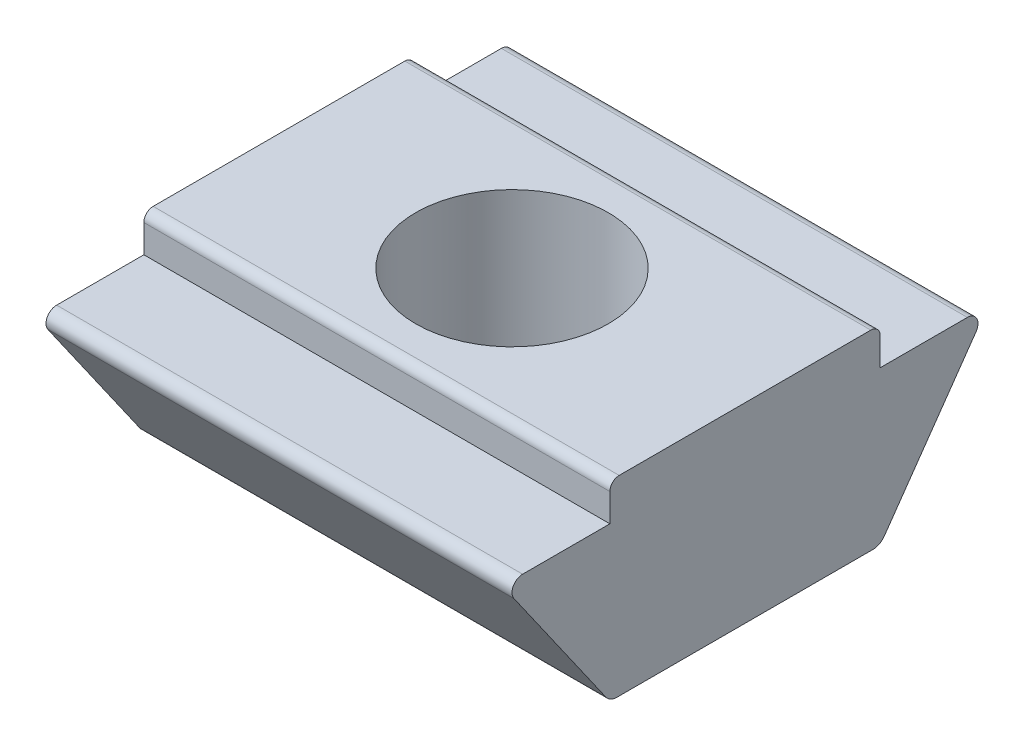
ISO-10303-21;
HEADER;
FILE_DESCRIPTION(('STEP AP214'),'2;1');
FILE_NAME('part.step','',(''),(''),'','','');
FILE_SCHEMA(('AUTOMOTIVE_DESIGN { 1 0 10303 214 1 1 1 1 }'));
ENDSEC;
DATA;
#1=APPLICATION_CONTEXT('core data for automotive mechanical design processes');
#2=APPLICATION_PROTOCOL_DEFINITION('international standard','automotive_design',2000,#1);
#3=PRODUCT_CONTEXT('',#1,'mechanical');
#4=PRODUCT('Part','Part','',(#3));
#5=PRODUCT_RELATED_PRODUCT_CATEGORY('part','',(#4));
#6=PRODUCT_DEFINITION_FORMATION('','',#4);
#7=PRODUCT_DEFINITION_CONTEXT('part definition',#1,'design');
#8=PRODUCT_DEFINITION('design','',#6,#7);
#9=PRODUCT_DEFINITION_SHAPE('','',#8);
#10=(LENGTH_UNIT() NAMED_UNIT(*) SI_UNIT(.MILLI.,.METRE.));
#11=(NAMED_UNIT(*) PLANE_ANGLE_UNIT() SI_UNIT($,.RADIAN.));
#12=(NAMED_UNIT(*) SI_UNIT($,.STERADIAN.) SOLID_ANGLE_UNIT());
#13=UNCERTAINTY_MEASURE_WITH_UNIT(LENGTH_MEASURE(1.E-05),#10,'distance_accuracy_value','');
#14=(GEOMETRIC_REPRESENTATION_CONTEXT(3) GLOBAL_UNCERTAINTY_ASSIGNED_CONTEXT((#13)) GLOBAL_UNIT_ASSIGNED_CONTEXT((#10,
#11,#12)) REPRESENTATION_CONTEXT('',''));
#15=CARTESIAN_POINT('',(0.,0.,0.));
#16=DIRECTION('',(0.,0.,1.));
#17=DIRECTION('',(1.,0.,0.));
#18=AXIS2_PLACEMENT_3D('',#15,#16,#17);
#19=CARTESIAN_POINT('',(5.,-0.358745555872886,-4.95878757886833));
#20=DIRECTION('',(0.,0.57344542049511,0.819243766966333));
#21=DIRECTION('',(0.,-0.819243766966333,0.57344542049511));
#22=AXIS2_PLACEMENT_3D('',#19,#20,#21);
#23=PLANE('',#22);
#24=DIRECTION('',(0.,0.819243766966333,-0.57344542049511));
#25=VECTOR('',#24,1.);
#26=CARTESIAN_POINT('',(5.,-0.358745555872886,-4.95878757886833));
#27=LINE('',#26,#25);
#28=CARTESIAN_POINT('',(5.,-3.17203362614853,-2.98957252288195));
#29=VERTEX_POINT('',#28);
#30=CARTESIAN_POINT('',(5.,-0.358745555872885,-4.95878757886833));
#31=VERTEX_POINT('',#30);
#32=EDGE_CURVE('E136',#29,#31,#27,.T.);
#33=ORIENTED_EDGE('',*,*,#32,.F.);
#34=DIRECTION('',(-1.,0.,0.));
#35=VECTOR('',#34,1.);
#36=CARTESIAN_POINT('',(5.,-3.17203362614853,-2.98957252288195));
#37=LINE('',#36,#35);
#38=CARTESIAN_POINT('',(-5.,-3.17203362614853,-2.98957252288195));
#39=VERTEX_POINT('',#38);
#40=EDGE_CURVE('E183',#29,#39,#37,.T.);
#41=ORIENTED_EDGE('',*,*,#40,.T.);
#42=DIRECTION('',(0.,0.819243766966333,-0.57344542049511));
#43=VECTOR('',#42,1.);
#44=CARTESIAN_POINT('',(-5.,-0.358745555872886,-4.95878757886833));
#45=LINE('',#44,#43);
#46=CARTESIAN_POINT('',(-5.,-0.358745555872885,-4.95878757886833));
#47=VERTEX_POINT('',#46);
#48=EDGE_CURVE('E158',#39,#47,#45,.T.);
#49=ORIENTED_EDGE('',*,*,#48,.T.);
#50=DIRECTION('',(-1.,0.,0.));
#51=VECTOR('',#50,1.);
#52=CARTESIAN_POINT('',(5.,-0.358745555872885,-4.95878757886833));
#53=LINE('',#52,#51);
#54=EDGE_CURVE('E151',#31,#47,#53,.T.);
#55=ORIENTED_EDGE('',*,*,#54,.F.);
#56=EDGE_LOOP('',(#33,#41,#49,#55));
#57=FACE_BOUND('',#56,.T.);
#58=ADVANCED_FACE('F34',(#57),#23,.F.);
#59=CARTESIAN_POINT('',(5.,-0.227999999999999,-4.772));
#60=DIRECTION('',(-1.,0.,0.));
#61=DIRECTION('',(0.,0.,1.));
#62=AXIS2_PLACEMENT_3D('',#59,#60,#61);
#63=CYLINDRICAL_SURFACE('',#62,0.228000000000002);
#64=CARTESIAN_POINT('',(-5.,-0.227999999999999,-4.772));
#65=DIRECTION('',(1.,0.,0.));
#66=DIRECTION('',(0.,0.,1.));
#67=AXIS2_PLACEMENT_3D('',#64,#65,#66);
#68=CIRCLE('',#67,0.228000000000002);
#69=CARTESIAN_POINT('',(-5.,0.,-4.772));
#70=VERTEX_POINT('',#69);
#71=EDGE_CURVE('E244',#47,#70,#68,.T.);
#72=ORIENTED_EDGE('',*,*,#71,.T.);
#73=DIRECTION('',(-1.,0.,0.));
#74=VECTOR('',#73,1.);
#75=CARTESIAN_POINT('',(5.,0.,-4.772));
#76=LINE('',#75,#74);
#77=CARTESIAN_POINT('',(5.,0.,-4.772));
#78=VERTEX_POINT('',#77);
#79=EDGE_CURVE('E153',#78,#70,#76,.T.);
#80=ORIENTED_EDGE('',*,*,#79,.F.);
#81=CARTESIAN_POINT('',(5.,-0.227999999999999,-4.772));
#82=DIRECTION('',(1.,0.,0.));
#83=DIRECTION('',(0.,0.,1.));
#84=AXIS2_PLACEMENT_3D('',#81,#82,#83);
#85=CIRCLE('',#84,0.228000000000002);
#86=EDGE_CURVE('E139',#31,#78,#85,.T.);
#87=ORIENTED_EDGE('',*,*,#86,.F.);
#88=ORIENTED_EDGE('',*,*,#54,.T.);
#89=EDGE_LOOP('',(#72,#80,#87,#88));
#90=FACE_BOUND('',#89,.T.);
#91=ADVANCED_FACE('F150',(#90),#63,.T.);
#92=CARTESIAN_POINT('',(5.,0.,-2.9));
#93=DIRECTION('',(0.,-1.,0.));
#94=DIRECTION('',(0.,0.,-1.));
#95=AXIS2_PLACEMENT_3D('',#92,#93,#94);
#96=PLANE('',#95);
#97=DIRECTION('',(0.,0.,1.));
#98=VECTOR('',#97,1.);
#99=CARTESIAN_POINT('',(-5.,0.,-2.9));
#100=LINE('',#99,#98);
#101=CARTESIAN_POINT('',(-5.,0.,-2.9));
#102=VERTEX_POINT('',#101);
#103=EDGE_CURVE('E237',#70,#102,#100,.T.);
#104=ORIENTED_EDGE('',*,*,#103,.T.);
#105=DIRECTION('',(-1.,0.,0.));
#106=VECTOR('',#105,1.);
#107=CARTESIAN_POINT('',(5.,0.,-2.9));
#108=LINE('',#107,#106);
#109=CARTESIAN_POINT('',(5.,0.,-2.9));
#110=VERTEX_POINT('',#109);
#111=EDGE_CURVE('E164',#110,#102,#108,.T.);
#112=ORIENTED_EDGE('',*,*,#111,.F.);
#113=DIRECTION('',(0.,0.,1.));
#114=VECTOR('',#113,1.);
#115=CARTESIAN_POINT('',(5.,0.,-2.9));
#116=LINE('',#115,#114);
#117=EDGE_CURVE('E155',#78,#110,#116,.T.);
#118=ORIENTED_EDGE('',*,*,#117,.F.);
#119=ORIENTED_EDGE('',*,*,#79,.T.);
#120=EDGE_LOOP('',(#104,#112,#118,#119));
#121=FACE_BOUND('',#120,.T.);
#122=ADVANCED_FACE('F267',(#121),#96,.F.);
#123=CARTESIAN_POINT('',(5.,0.799999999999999,-2.9));
#124=DIRECTION('',(0.,0.,1.));
#125=DIRECTION('',(1.,0.,0.));
#126=AXIS2_PLACEMENT_3D('',#123,#124,#125);
#127=PLANE('',#126);
#128=DIRECTION('',(0.,1.,0.));
#129=VECTOR('',#128,1.);
#130=CARTESIAN_POINT('',(-5.,0.799999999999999,-2.9));
#131=LINE('',#130,#129);
#132=CARTESIAN_POINT('',(-5.,0.6,-2.9));
#133=VERTEX_POINT('',#132);
#134=EDGE_CURVE('E231',#102,#133,#131,.T.);
#135=ORIENTED_EDGE('',*,*,#134,.T.);
#136=DIRECTION('',(-1.,0.,0.));
#137=VECTOR('',#136,1.);
#138=CARTESIAN_POINT('',(5.,0.6,-2.9));
#139=LINE('',#138,#137);
#140=CARTESIAN_POINT('',(5.,0.6,-2.9));
#141=VERTEX_POINT('',#140);
#142=EDGE_CURVE('E174',#133,#141,#139,.F.);
#143=ORIENTED_EDGE('',*,*,#142,.T.);
#144=DIRECTION('',(0.,1.,0.));
#145=VECTOR('',#144,1.);
#146=CARTESIAN_POINT('',(5.,0.799999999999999,-2.9));
#147=LINE('',#146,#145);
#148=EDGE_CURVE('E234',#110,#141,#147,.T.);
#149=ORIENTED_EDGE('',*,*,#148,.F.);
#150=ORIENTED_EDGE('',*,*,#111,.T.);
#151=EDGE_LOOP('',(#135,#143,#149,#150));
#152=FACE_BOUND('',#151,.T.);
#153=ADVANCED_FACE('F230',(#152),#127,.F.);
#154=CARTESIAN_POINT('',(5.,0.799999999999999,2.9));
#155=DIRECTION('',(0.,-1.,0.));
#156=DIRECTION('',(0.,0.,-1.));
#157=AXIS2_PLACEMENT_3D('',#154,#155,#156);
#158=PLANE('',#157);
#159=CARTESIAN_POINT('',(0.,0.799999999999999,0.));
#160=DIRECTION('',(0.,1.,0.));
#161=DIRECTION('',(0.,0.,1.));
#162=AXIS2_PLACEMENT_3D('',#159,#160,#161);
#163=CIRCLE('',#162,2.067);
#164=CARTESIAN_POINT('',(0.,0.799999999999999,2.067));
#165=VERTEX_POINT('',#164);
#166=EDGE_CURVE('E336',#165,#165,#163,.T.);
#167=ORIENTED_EDGE('',*,*,#166,.F.);
#168=EDGE_LOOP('',(#167));
#169=FACE_BOUND('',#168,.T.);
#170=DIRECTION('',(0.,0.,1.));
#171=VECTOR('',#170,1.);
#172=CARTESIAN_POINT('',(5.,0.799999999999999,2.9));
#173=LINE('',#172,#171);
#174=CARTESIAN_POINT('',(5.,0.799999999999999,-2.7));
#175=VERTEX_POINT('',#174);
#176=CARTESIAN_POINT('',(5.,0.799999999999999,2.7));
#177=VERTEX_POINT('',#176);
#178=EDGE_CURVE('E269',#175,#177,#173,.T.);
#179=ORIENTED_EDGE('',*,*,#178,.F.);
#180=DIRECTION('',(-1.,0.,0.));
#181=VECTOR('',#180,1.);
#182=CARTESIAN_POINT('',(5.,0.799999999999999,-2.7));
#183=LINE('',#182,#181);
#184=CARTESIAN_POINT('',(-5.,0.799999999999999,-2.7));
#185=VERTEX_POINT('',#184);
#186=EDGE_CURVE('E162',#175,#185,#183,.T.);
#187=ORIENTED_EDGE('',*,*,#186,.T.);
#188=DIRECTION('',(0.,0.,1.));
#189=VECTOR('',#188,1.);
#190=CARTESIAN_POINT('',(-5.,0.799999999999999,2.9));
#191=LINE('',#190,#189);
#192=CARTESIAN_POINT('',(-5.,0.799999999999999,2.7));
#193=VERTEX_POINT('',#192);
#194=EDGE_CURVE('E239',#185,#193,#191,.T.);
#195=ORIENTED_EDGE('',*,*,#194,.T.);
#196=DIRECTION('',(-1.,0.,0.));
#197=VECTOR('',#196,1.);
#198=CARTESIAN_POINT('',(5.,0.799999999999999,2.7));
#199=LINE('',#198,#197);
#200=EDGE_CURVE('E160',#193,#177,#199,.F.);
#201=ORIENTED_EDGE('',*,*,#200,.T.);
#202=EDGE_LOOP('',(#179,#187,#195,#201));
#203=FACE_BOUND('',#202,.T.);
#204=ADVANCED_FACE('F282',(#169,#203),#158,.F.);
#205=CARTESIAN_POINT('',(5.,0.,2.9));
#206=DIRECTION('',(0.,0.,-1.));
#207=DIRECTION('',(-1.,0.,0.));
#208=AXIS2_PLACEMENT_3D('',#205,#206,#207);
#209=PLANE('',#208);
#210=DIRECTION('',(0.,-1.,0.));
#211=VECTOR('',#210,1.);
#212=CARTESIAN_POINT('',(5.,0.,2.9));
#213=LINE('',#212,#211);
#214=CARTESIAN_POINT('',(5.,0.599999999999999,2.9));
#215=VERTEX_POINT('',#214);
#216=CARTESIAN_POINT('',(5.,0.,2.9));
#217=VERTEX_POINT('',#216);
#218=EDGE_CURVE('E262',#215,#217,#213,.T.);
#219=ORIENTED_EDGE('',*,*,#218,.F.);
#220=DIRECTION('',(-1.,0.,0.));
#221=VECTOR('',#220,1.);
#222=CARTESIAN_POINT('',(5.,0.599999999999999,2.9));
#223=LINE('',#222,#221);
#224=CARTESIAN_POINT('',(-5.,0.599999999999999,2.9));
#225=VERTEX_POINT('',#224);
#226=EDGE_CURVE('E180',#215,#225,#223,.T.);
#227=ORIENTED_EDGE('',*,*,#226,.T.);
#228=DIRECTION('',(0.,-1.,0.));
#229=VECTOR('',#228,1.);
#230=CARTESIAN_POINT('',(-5.,0.,2.9));
#231=LINE('',#230,#229);
#232=CARTESIAN_POINT('',(-5.,0.,2.9));
#233=VERTEX_POINT('',#232);
#234=EDGE_CURVE('E242',#225,#233,#231,.T.);
#235=ORIENTED_EDGE('',*,*,#234,.T.);
#236=DIRECTION('',(-1.,0.,0.));
#237=VECTOR('',#236,1.);
#238=CARTESIAN_POINT('',(5.,0.,2.9));
#239=LINE('',#238,#237);
#240=EDGE_CURVE('E222',#217,#233,#239,.T.);
#241=ORIENTED_EDGE('',*,*,#240,.F.);
#242=EDGE_LOOP('',(#219,#227,#235,#241));
#243=FACE_BOUND('',#242,.T.);
#244=ADVANCED_FACE('F277',(#243),#209,.F.);
#245=CARTESIAN_POINT('',(5.,0.,4.772));
#246=DIRECTION('',(0.,-1.,0.));
#247=DIRECTION('',(0.,0.,-1.));
#248=AXIS2_PLACEMENT_3D('',#245,#246,#247);
#249=PLANE('',#248);
#250=DIRECTION('',(0.,0.,1.));
#251=VECTOR('',#250,1.);
#252=CARTESIAN_POINT('',(-5.,0.,4.772));
#253=LINE('',#252,#251);
#254=CARTESIAN_POINT('',(-5.,0.,4.772));
#255=VERTEX_POINT('',#254);
#256=EDGE_CURVE('E214',#233,#255,#253,.T.);
#257=ORIENTED_EDGE('',*,*,#256,.T.);
#258=DIRECTION('',(-1.,0.,0.));
#259=VECTOR('',#258,1.);
#260=CARTESIAN_POINT('',(5.,0.,4.772));
#261=LINE('',#260,#259);
#262=CARTESIAN_POINT('',(5.,0.,4.772));
#263=VERTEX_POINT('',#262);
#264=EDGE_CURVE('E219',#263,#255,#261,.T.);
#265=ORIENTED_EDGE('',*,*,#264,.F.);
#266=DIRECTION('',(0.,0.,1.));
#267=VECTOR('',#266,1.);
#268=CARTESIAN_POINT('',(5.,0.,4.772));
#269=LINE('',#268,#267);
#270=EDGE_CURVE('E259',#217,#263,#269,.T.);
#271=ORIENTED_EDGE('',*,*,#270,.F.);
#272=ORIENTED_EDGE('',*,*,#240,.T.);
#273=EDGE_LOOP('',(#257,#265,#271,#272));
#274=FACE_BOUND('',#273,.T.);
#275=ADVANCED_FACE('F251',(#274),#249,.F.);
#276=CARTESIAN_POINT('',(5.,-0.228,4.772));
#277=DIRECTION('',(-1.,0.,0.));
#278=DIRECTION('',(0.,0.,1.));
#279=AXIS2_PLACEMENT_3D('',#276,#277,#278);
#280=CYLINDRICAL_SURFACE('',#279,0.228000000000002);
#281=CARTESIAN_POINT('',(-5.,-0.228,4.772));
#282=DIRECTION('',(1.,0.,0.));
#283=DIRECTION('',(0.,0.,1.));
#284=AXIS2_PLACEMENT_3D('',#281,#282,#283);
#285=CIRCLE('',#284,0.228000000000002);
#286=CARTESIAN_POINT('',(-5.,-0.358745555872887,4.95878757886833));
#287=VERTEX_POINT('',#286);
#288=EDGE_CURVE('E211',#255,#287,#285,.T.);
#289=ORIENTED_EDGE('',*,*,#288,.T.);
#290=DIRECTION('',(-1.,0.,0.));
#291=VECTOR('',#290,1.);
#292=CARTESIAN_POINT('',(5.,-0.358745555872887,4.95878757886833));
#293=LINE('',#292,#291);
#294=CARTESIAN_POINT('',(5.,-0.358745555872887,4.95878757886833));
#295=VERTEX_POINT('',#294);
#296=EDGE_CURVE('E201',#295,#287,#293,.T.);
#297=ORIENTED_EDGE('',*,*,#296,.F.);
#298=CARTESIAN_POINT('',(5.,-0.228,4.772));
#299=DIRECTION('',(1.,0.,0.));
#300=DIRECTION('',(0.,0.,1.));
#301=AXIS2_PLACEMENT_3D('',#298,#299,#300);
#302=CIRCLE('',#301,0.228000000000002);
#303=EDGE_CURVE('E258',#263,#295,#302,.T.);
#304=ORIENTED_EDGE('',*,*,#303,.F.);
#305=ORIENTED_EDGE('',*,*,#264,.T.);
#306=EDGE_LOOP('',(#289,#297,#304,#305));
#307=FACE_BOUND('',#306,.T.);
#308=ADVANCED_FACE('F257',(#307),#280,.T.);
#309=CARTESIAN_POINT('',(5.,-3.3,2.9));
#310=DIRECTION('',(0.,0.57344542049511,-0.819243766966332));
#311=DIRECTION('',(0.,0.819243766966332,0.57344542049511));
#312=AXIS2_PLACEMENT_3D('',#309,#310,#311);
#313=PLANE('',#312);
#314=DIRECTION('',(0.,-0.819243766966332,-0.57344542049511));
#315=VECTOR('',#314,1.);
#316=CARTESIAN_POINT('',(-5.,-3.3,2.9));
#317=LINE('',#316,#315);
#318=CARTESIAN_POINT('',(-5.,-3.17203362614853,2.98957252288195));
#319=VERTEX_POINT('',#318);
#320=EDGE_CURVE('E207',#287,#319,#317,.T.);
#321=ORIENTED_EDGE('',*,*,#320,.T.);
#322=DIRECTION('',(-1.,0.,0.));
#323=VECTOR('',#322,1.);
#324=CARTESIAN_POINT('',(5.,-3.17203362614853,2.98957252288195));
#325=LINE('',#324,#323);
#326=CARTESIAN_POINT('',(5.,-3.17203362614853,2.98957252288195));
#327=VERTEX_POINT('',#326);
#328=EDGE_CURVE('E11',#319,#327,#325,.F.);
#329=ORIENTED_EDGE('',*,*,#328,.T.);
#330=DIRECTION('',(0.,-0.819243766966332,-0.57344542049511));
#331=VECTOR('',#330,1.);
#332=CARTESIAN_POINT('',(5.,-3.3,2.9));
#333=LINE('',#332,#331);
#334=EDGE_CURVE('E196',#295,#327,#333,.T.);
#335=ORIENTED_EDGE('',*,*,#334,.F.);
#336=ORIENTED_EDGE('',*,*,#296,.T.);
#337=EDGE_LOOP('',(#321,#329,#335,#336));
#338=FACE_BOUND('',#337,.T.);
#339=ADVANCED_FACE('F209',(#338),#313,.F.);
#340=CARTESIAN_POINT('',(5.,-3.3,-2.9));
#341=DIRECTION('',(0.,1.,0.));
#342=DIRECTION('',(0.,0.,1.));
#343=AXIS2_PLACEMENT_3D('',#340,#341,#342);
#344=PLANE('',#343);
#345=CARTESIAN_POINT('',(0.,-3.3,0.));
#346=DIRECTION('',(0.,1.,0.));
#347=DIRECTION('',(0.,0.,1.));
#348=AXIS2_PLACEMENT_3D('',#345,#346,#347);
#349=CIRCLE('',#348,2.067);
#350=CARTESIAN_POINT('',(0.,-3.3,2.067));
#351=VERTEX_POINT('',#350);
#352=EDGE_CURVE('E266',#351,#351,#349,.T.);
#353=ORIENTED_EDGE('',*,*,#352,.T.);
#354=EDGE_LOOP('',(#353));
#355=FACE_BOUND('',#354,.T.);
#356=DIRECTION('',(0.,0.,-1.));
#357=VECTOR('',#356,1.);
#358=CARTESIAN_POINT('',(-5.,-3.3,-2.9));
#359=LINE('',#358,#357);
#360=CARTESIAN_POINT('',(-5.,-3.3,2.74379939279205));
#361=VERTEX_POINT('',#360);
#362=CARTESIAN_POINT('',(-5.,-3.3,-2.74379939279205));
#363=VERTEX_POINT('',#362);
#364=EDGE_CURVE('E146',#361,#363,#359,.T.);
#365=ORIENTED_EDGE('',*,*,#364,.T.);
#366=DIRECTION('',(-1.,0.,0.));
#367=VECTOR('',#366,1.);
#368=CARTESIAN_POINT('',(5.,-3.3,-2.74379939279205));
#369=LINE('',#368,#367);
#370=CARTESIAN_POINT('',(5.,-3.3,-2.74379939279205));
#371=VERTEX_POINT('',#370);
#372=EDGE_CURVE('E55',#363,#371,#369,.F.);
#373=ORIENTED_EDGE('',*,*,#372,.T.);
#374=DIRECTION('',(0.,0.,-1.));
#375=VECTOR('',#374,1.);
#376=CARTESIAN_POINT('',(5.,-3.3,-2.9));
#377=LINE('',#376,#375);
#378=CARTESIAN_POINT('',(5.,-3.3,2.74379939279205));
#379=VERTEX_POINT('',#378);
#380=EDGE_CURVE('E195',#379,#371,#377,.T.);
#381=ORIENTED_EDGE('',*,*,#380,.F.);
#382=DIRECTION('',(-1.,0.,0.));
#383=VECTOR('',#382,1.);
#384=CARTESIAN_POINT('',(5.,-3.3,2.74379939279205));
#385=LINE('',#384,#383);
#386=EDGE_CURVE('E189',#379,#361,#385,.T.);
#387=ORIENTED_EDGE('',*,*,#386,.T.);
#388=EDGE_LOOP('',(#365,#373,#381,#387));
#389=FACE_BOUND('',#388,.T.);
#390=ADVANCED_FACE('F199',(#355,#389),#344,.F.);
#391=CARTESIAN_POINT('',(5.,-0.228,4.772));
#392=DIRECTION('',(-1.,0.,0.));
#393=DIRECTION('',(0.,0.,1.));
#394=AXIS2_PLACEMENT_3D('',#391,#392,#393);
#395=PLANE('',#394);
#396=ORIENTED_EDGE('',*,*,#380,.T.);
#397=CARTESIAN_POINT('',(5.,-3.,-2.74379939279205));
#398=DIRECTION('',(-1.,0.,0.));
#399=DIRECTION('',(0.,0.,1.));
#400=AXIS2_PLACEMENT_3D('',#397,#398,#399);
#401=CIRCLE('',#400,0.3);
#402=EDGE_CURVE('E42',#371,#29,#401,.F.);
#403=ORIENTED_EDGE('',*,*,#402,.T.);
#404=ORIENTED_EDGE('',*,*,#32,.T.);
#405=ORIENTED_EDGE('',*,*,#86,.T.);
#406=ORIENTED_EDGE('',*,*,#117,.T.);
#407=ORIENTED_EDGE('',*,*,#148,.T.);
#408=CARTESIAN_POINT('',(5.,0.6,-2.7));
#409=DIRECTION('',(-1.,0.,0.));
#410=DIRECTION('',(0.,0.,1.));
#411=AXIS2_PLACEMENT_3D('',#408,#409,#410);
#412=CIRCLE('',#411,0.2);
#413=EDGE_CURVE('E178',#141,#175,#412,.F.);
#414=ORIENTED_EDGE('',*,*,#413,.T.);
#415=ORIENTED_EDGE('',*,*,#178,.T.);
#416=CARTESIAN_POINT('',(5.,0.599999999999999,2.7));
#417=DIRECTION('',(-1.,0.,0.));
#418=DIRECTION('',(0.,0.,1.));
#419=AXIS2_PLACEMENT_3D('',#416,#417,#418);
#420=CIRCLE('',#419,0.2);
#421=EDGE_CURVE('E176',#177,#215,#420,.F.);
#422=ORIENTED_EDGE('',*,*,#421,.T.);
#423=ORIENTED_EDGE('',*,*,#218,.T.);
#424=ORIENTED_EDGE('',*,*,#270,.T.);
#425=ORIENTED_EDGE('',*,*,#303,.T.);
#426=ORIENTED_EDGE('',*,*,#334,.T.);
#427=CARTESIAN_POINT('',(5.,-3.,2.74379939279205));
#428=DIRECTION('',(-1.,0.,0.));
#429=DIRECTION('',(0.,0.,1.));
#430=AXIS2_PLACEMENT_3D('',#427,#428,#429);
#431=CIRCLE('',#430,0.3);
#432=EDGE_CURVE('E193',#327,#379,#431,.F.);
#433=ORIENTED_EDGE('',*,*,#432,.T.);
#434=EDGE_LOOP('',(#396,#403,#404,#405,#406,#407,#414,#415,#422,#423,#424,#425,#426,#433));
#435=FACE_BOUND('',#434,.T.);
#436=ADVANCED_FACE('F138',(#435),#395,.F.);
#437=CARTESIAN_POINT('',(-5.,-0.228,4.772));
#438=DIRECTION('',(-1.,0.,0.));
#439=DIRECTION('',(0.,0.,1.));
#440=AXIS2_PLACEMENT_3D('',#437,#438,#439);
#441=PLANE('',#440);
#442=ORIENTED_EDGE('',*,*,#48,.F.);
#443=CARTESIAN_POINT('',(-5.,-3.,-2.74379939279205));
#444=DIRECTION('',(-1.,0.,0.));
#445=DIRECTION('',(0.,0.,1.));
#446=AXIS2_PLACEMENT_3D('',#443,#444,#445);
#447=CIRCLE('',#446,0.3);
#448=EDGE_CURVE('E187',#39,#363,#447,.T.);
#449=ORIENTED_EDGE('',*,*,#448,.T.);
#450=ORIENTED_EDGE('',*,*,#364,.F.);
#451=CARTESIAN_POINT('',(-5.,-3.,2.74379939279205));
#452=DIRECTION('',(-1.,0.,0.));
#453=DIRECTION('',(0.,0.,1.));
#454=AXIS2_PLACEMENT_3D('',#451,#452,#453);
#455=CIRCLE('',#454,0.3);
#456=EDGE_CURVE('E185',#361,#319,#455,.T.);
#457=ORIENTED_EDGE('',*,*,#456,.T.);
#458=ORIENTED_EDGE('',*,*,#320,.F.);
#459=ORIENTED_EDGE('',*,*,#288,.F.);
#460=ORIENTED_EDGE('',*,*,#256,.F.);
#461=ORIENTED_EDGE('',*,*,#234,.F.);
#462=CARTESIAN_POINT('',(-5.,0.599999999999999,2.7));
#463=DIRECTION('',(-1.,0.,0.));
#464=DIRECTION('',(0.,0.,1.));
#465=AXIS2_PLACEMENT_3D('',#462,#463,#464);
#466=CIRCLE('',#465,0.2);
#467=EDGE_CURVE('E170',#225,#193,#466,.T.);
#468=ORIENTED_EDGE('',*,*,#467,.T.);
#469=ORIENTED_EDGE('',*,*,#194,.F.);
#470=CARTESIAN_POINT('',(-5.,0.6,-2.7));
#471=DIRECTION('',(-1.,0.,0.));
#472=DIRECTION('',(0.,0.,1.));
#473=AXIS2_PLACEMENT_3D('',#470,#471,#472);
#474=CIRCLE('',#473,0.2);
#475=EDGE_CURVE('E172',#185,#133,#474,.T.);
#476=ORIENTED_EDGE('',*,*,#475,.T.);
#477=ORIENTED_EDGE('',*,*,#134,.F.);
#478=ORIENTED_EDGE('',*,*,#103,.F.);
#479=ORIENTED_EDGE('',*,*,#71,.F.);
#480=EDGE_LOOP('',(#442,#449,#450,#457,#458,#459,#460,#461,#468,#469,#476,#477,#478,#479));
#481=FACE_BOUND('',#480,.T.);
#482=ADVANCED_FACE('F205',(#481),#441,.T.);
#483=CARTESIAN_POINT('',(5.,0.6,-2.7));
#484=DIRECTION('',(-1.,0.,0.));
#485=DIRECTION('',(0.,0.,1.));
#486=AXIS2_PLACEMENT_3D('',#483,#484,#485);
#487=CYLINDRICAL_SURFACE('',#486,0.2);
#488=ORIENTED_EDGE('',*,*,#413,.F.);
#489=ORIENTED_EDGE('',*,*,#142,.F.);
#490=ORIENTED_EDGE('',*,*,#475,.F.);
#491=ORIENTED_EDGE('',*,*,#186,.F.);
#492=EDGE_LOOP('',(#488,#489,#490,#491));
#493=FACE_BOUND('',#492,.T.);
#494=ADVANCED_FACE('F287',(#493),#487,.T.);
#495=CARTESIAN_POINT('',(5.,0.599999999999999,2.7));
#496=DIRECTION('',(-1.,0.,0.));
#497=DIRECTION('',(0.,0.,1.));
#498=AXIS2_PLACEMENT_3D('',#495,#496,#497);
#499=CYLINDRICAL_SURFACE('',#498,0.2);
#500=ORIENTED_EDGE('',*,*,#421,.F.);
#501=ORIENTED_EDGE('',*,*,#200,.F.);
#502=ORIENTED_EDGE('',*,*,#467,.F.);
#503=ORIENTED_EDGE('',*,*,#226,.F.);
#504=EDGE_LOOP('',(#500,#501,#502,#503));
#505=FACE_BOUND('',#504,.T.);
#506=ADVANCED_FACE('F284',(#505),#499,.T.);
#507=CARTESIAN_POINT('',(5.,-3.,-2.74379939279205));
#508=DIRECTION('',(-1.,0.,0.));
#509=DIRECTION('',(0.,0.,1.));
#510=AXIS2_PLACEMENT_3D('',#507,#508,#509);
#511=CYLINDRICAL_SURFACE('',#510,0.3);
#512=ORIENTED_EDGE('',*,*,#402,.F.);
#513=ORIENTED_EDGE('',*,*,#372,.F.);
#514=ORIENTED_EDGE('',*,*,#448,.F.);
#515=ORIENTED_EDGE('',*,*,#40,.F.);
#516=EDGE_LOOP('',(#512,#513,#514,#515));
#517=FACE_BOUND('',#516,.T.);
#518=ADVANCED_FACE('F286',(#517),#511,.T.);
#519=CARTESIAN_POINT('',(5.,-3.,2.74379939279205));
#520=DIRECTION('',(-1.,0.,0.));
#521=DIRECTION('',(0.,0.,1.));
#522=AXIS2_PLACEMENT_3D('',#519,#520,#521);
#523=CYLINDRICAL_SURFACE('',#522,0.3);
#524=ORIENTED_EDGE('',*,*,#432,.F.);
#525=ORIENTED_EDGE('',*,*,#328,.F.);
#526=ORIENTED_EDGE('',*,*,#456,.F.);
#527=ORIENTED_EDGE('',*,*,#386,.F.);
#528=EDGE_LOOP('',(#524,#525,#526,#527));
#529=FACE_BOUND('',#528,.T.);
#530=ADVANCED_FACE('F36',(#529),#523,.T.);
#531=CARTESIAN_POINT('',(0.,0.799999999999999,0.));
#532=DIRECTION('',(0.,1.,0.));
#533=DIRECTION('',(0.,0.,1.));
#534=AXIS2_PLACEMENT_3D('',#531,#532,#533);
#535=CYLINDRICAL_SURFACE('',#534,2.067);
#536=ORIENTED_EDGE('',*,*,#352,.F.);
#537=EDGE_LOOP('',(#536));
#538=FACE_BOUND('',#537,.T.);
#539=ORIENTED_EDGE('',*,*,#166,.T.);
#540=EDGE_LOOP('',(#539));
#541=FACE_BOUND('',#540,.T.);
#542=ADVANCED_FACE('F325',(#538,#541),#535,.F.);
#543=CLOSED_SHELL('',(#58,#91,#122,#153,#204,#244,#275,#308,#339,#390,#436,#482,#494,#506,#518,
#530,#542));
#544=MANIFOLD_SOLID_BREP('B2',#543);
#545=ADVANCED_BREP_SHAPE_REPRESENTATION('',(#18,#544),#14);
#546=SHAPE_DEFINITION_REPRESENTATION(#9,#545);
ENDSEC;
END-ISO-10303-21;
